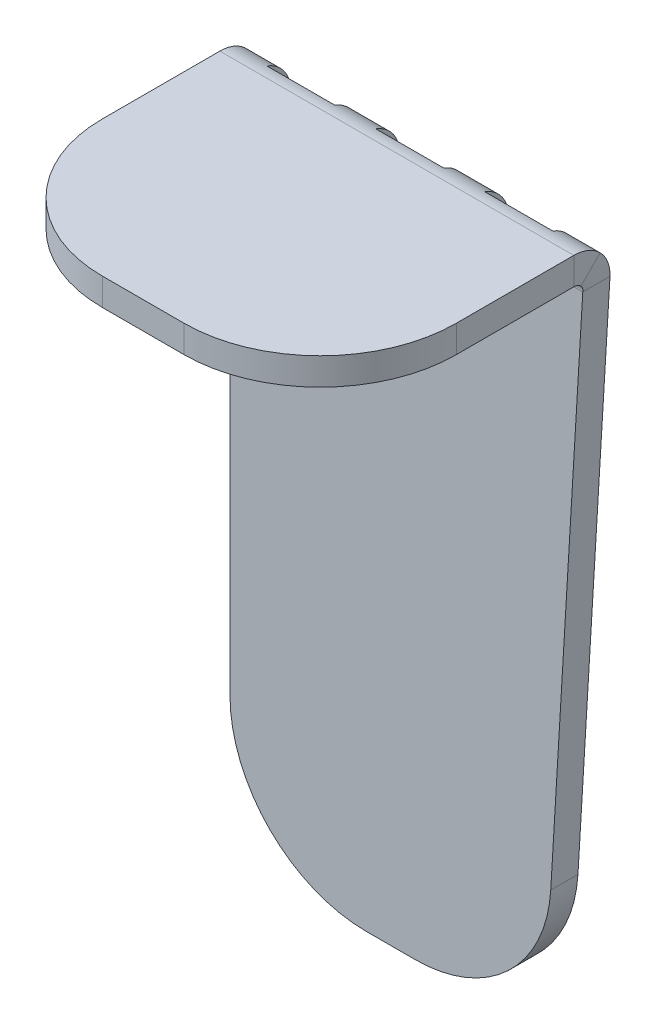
ISO-10303-21;
HEADER;
FILE_DESCRIPTION(('STEP AP214'),'2;1');
FILE_NAME('part.step','',(''),(''),'','','');
FILE_SCHEMA(('AUTOMOTIVE_DESIGN { 1 0 10303 214 1 1 1 1 }'));
ENDSEC;
DATA;
#1=APPLICATION_CONTEXT('core data for automotive mechanical design processes');
#2=APPLICATION_PROTOCOL_DEFINITION('international standard','automotive_design',2000,#1);
#3=PRODUCT_CONTEXT('',#1,'mechanical');
#4=PRODUCT('Part','Part','',(#3));
#5=PRODUCT_RELATED_PRODUCT_CATEGORY('part','',(#4));
#6=PRODUCT_DEFINITION_FORMATION('','',#4);
#7=PRODUCT_DEFINITION_CONTEXT('part definition',#1,'design');
#8=PRODUCT_DEFINITION('design','',#6,#7);
#9=PRODUCT_DEFINITION_SHAPE('','',#8);
#10=(LENGTH_UNIT() NAMED_UNIT(*) SI_UNIT(.MILLI.,.METRE.));
#11=(NAMED_UNIT(*) PLANE_ANGLE_UNIT() SI_UNIT($,.RADIAN.));
#12=(NAMED_UNIT(*) SI_UNIT($,.STERADIAN.) SOLID_ANGLE_UNIT());
#13=UNCERTAINTY_MEASURE_WITH_UNIT(LENGTH_MEASURE(1.E-05),#10,'distance_accuracy_value','');
#14=(GEOMETRIC_REPRESENTATION_CONTEXT(3) GLOBAL_UNCERTAINTY_ASSIGNED_CONTEXT((#13)) GLOBAL_UNIT_ASSIGNED_CONTEXT((#10,
#11,#12)) REPRESENTATION_CONTEXT('',''));
#15=CARTESIAN_POINT('',(0.,0.,0.));
#16=DIRECTION('',(0.,0.,1.));
#17=DIRECTION('',(1.,0.,0.));
#18=AXIS2_PLACEMENT_3D('',#15,#16,#17);
#19=CARTESIAN_POINT('',(0.,-20.6259060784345,19.3740939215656));
#20=DIRECTION('',(0.,1.,0.));
#21=DIRECTION('',(-1.,0.,0.));
#22=AXIS2_PLACEMENT_3D('',#19,#20,#21);
#23=PLANE('',#22);
#24=DIRECTION('',(0.,0.,1.));
#25=VECTOR('',#24,1.);
#26=CARTESIAN_POINT('',(26.,-20.6259060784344,-0.625906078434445));
#27=LINE('',#26,#25);
#28=CARTESIAN_POINT('',(26.,-20.6259060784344,0.743199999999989));
#29=VERTEX_POINT('',#28);
#30=CARTESIAN_POINT('',(26.,-20.6259060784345,9.37409392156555));
#31=VERTEX_POINT('',#30);
#32=EDGE_CURVE('E290',#29,#31,#27,.T.);
#33=ORIENTED_EDGE('',*,*,#32,.T.);
#34=CARTESIAN_POINT('',(16.,-20.6259060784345,9.37409392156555));
#35=DIRECTION('',(0.,1.,0.));
#36=DIRECTION('',(0.,0.,1.));
#37=AXIS2_PLACEMENT_3D('',#34,#35,#36);
#38=CIRCLE('',#37,10.);
#39=CARTESIAN_POINT('',(16.,-20.6259060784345,19.3740939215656));
#40=VERTEX_POINT('',#39);
#41=EDGE_CURVE('E324',#31,#40,#38,.F.);
#42=ORIENTED_EDGE('',*,*,#41,.T.);
#43=DIRECTION('',(-1.,0.,0.));
#44=VECTOR('',#43,1.);
#45=CARTESIAN_POINT('',(0.,-20.6259060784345,19.3740939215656));
#46=LINE('',#45,#44);
#47=CARTESIAN_POINT('',(10.,-20.6259060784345,19.3740939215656));
#48=VERTEX_POINT('',#47);
#49=EDGE_CURVE('E285',#40,#48,#46,.T.);
#50=ORIENTED_EDGE('',*,*,#49,.T.);
#51=CARTESIAN_POINT('',(10.,-20.6259060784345,9.37409392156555));
#52=DIRECTION('',(0.,1.,0.));
#53=DIRECTION('',(0.,0.,1.));
#54=AXIS2_PLACEMENT_3D('',#51,#52,#53);
#55=CIRCLE('',#54,10.);
#56=CARTESIAN_POINT('',(0.,-20.6259060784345,9.37409392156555));
#57=VERTEX_POINT('',#56);
#58=EDGE_CURVE('E321',#48,#57,#55,.F.);
#59=ORIENTED_EDGE('',*,*,#58,.T.);
#60=DIRECTION('',(0.,0.,-1.));
#61=VECTOR('',#60,1.);
#62=CARTESIAN_POINT('',(0.,-20.6259060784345,19.3740939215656));
#63=LINE('',#62,#61);
#64=CARTESIAN_POINT('',(0.,-20.6259060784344,0.743199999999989));
#65=VERTEX_POINT('',#64);
#66=EDGE_CURVE('E311',#57,#65,#63,.T.);
#67=ORIENTED_EDGE('',*,*,#66,.T.);
#68=DIRECTION('',(1.,0.,0.));
#69=VECTOR('',#68,1.);
#70=CARTESIAN_POINT('',(0.,-20.6259060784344,0.743199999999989));
#71=LINE('',#70,#69);
#72=EDGE_CURVE('E297',#65,#29,#71,.T.);
#73=ORIENTED_EDGE('',*,*,#72,.T.);
#74=EDGE_LOOP('',(#33,#42,#50,#59,#67,#73));
#75=FACE_BOUND('',#74,.T.);
#76=ADVANCED_FACE('F52',(#75),#23,.F.);
#77=CARTESIAN_POINT('',(0.,-18.6259060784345,19.3740939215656));
#78=DIRECTION('',(-1.,0.,0.));
#79=DIRECTION('',(0.,0.,-1.));
#80=AXIS2_PLACEMENT_3D('',#77,#78,#79);
#81=PLANE('',#80);
#82=ORIENTED_EDGE('',*,*,#66,.F.);
#83=DIRECTION('',(0.,-1.,0.));
#84=VECTOR('',#83,1.);
#85=CARTESIAN_POINT('',(0.,-18.6259060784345,9.37409392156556));
#86=LINE('',#85,#84);
#87=CARTESIAN_POINT('',(0.,-18.6259060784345,9.37409392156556));
#88=VERTEX_POINT('',#87);
#89=EDGE_CURVE('E12',#57,#88,#86,.F.);
#90=ORIENTED_EDGE('',*,*,#89,.T.);
#91=DIRECTION('',(0.,0.,-1.));
#92=VECTOR('',#91,1.);
#93=CARTESIAN_POINT('',(0.,-18.6259060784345,19.3740939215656));
#94=LINE('',#93,#92);
#95=CARTESIAN_POINT('',(0.,-18.6259060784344,0.74320000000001));
#96=VERTEX_POINT('',#95);
#97=EDGE_CURVE('E289',#88,#96,#94,.T.);
#98=ORIENTED_EDGE('',*,*,#97,.T.);
#99=DIRECTION('',(0.,1.,0.));
#100=VECTOR('',#99,1.);
#101=CARTESIAN_POINT('',(0.,-18.6259060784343,0.74320000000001));
#102=LINE('',#101,#100);
#103=EDGE_CURVE('E301',#65,#96,#102,.T.);
#104=ORIENTED_EDGE('',*,*,#103,.F.);
#105=EDGE_LOOP('',(#82,#90,#98,#104));
#106=FACE_BOUND('',#105,.T.);
#107=ADVANCED_FACE('F354',(#106),#81,.T.);
#108=CARTESIAN_POINT('',(0.,-18.6259060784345,19.3740939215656));
#109=DIRECTION('',(0.,0.,1.));
#110=DIRECTION('',(0.,-1.,0.));
#111=AXIS2_PLACEMENT_3D('',#108,#109,#110);
#112=PLANE('',#111);
#113=ORIENTED_EDGE('',*,*,#49,.F.);
#114=DIRECTION('',(0.,-1.,0.));
#115=VECTOR('',#114,1.);
#116=CARTESIAN_POINT('',(16.,-18.6259060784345,19.3740939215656));
#117=LINE('',#116,#115);
#118=CARTESIAN_POINT('',(16.,-18.6259060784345,19.3740939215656));
#119=VERTEX_POINT('',#118);
#120=EDGE_CURVE('E331',#40,#119,#117,.F.);
#121=ORIENTED_EDGE('',*,*,#120,.T.);
#122=DIRECTION('',(-1.,0.,0.));
#123=VECTOR('',#122,1.);
#124=CARTESIAN_POINT('',(0.,-18.6259060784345,19.3740939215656));
#125=LINE('',#124,#123);
#126=CARTESIAN_POINT('',(10.,-18.6259060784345,19.3740939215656));
#127=VERTEX_POINT('',#126);
#128=EDGE_CURVE('E280',#119,#127,#125,.T.);
#129=ORIENTED_EDGE('',*,*,#128,.T.);
#130=DIRECTION('',(0.,-1.,0.));
#131=VECTOR('',#130,1.);
#132=CARTESIAN_POINT('',(10.,-18.6259060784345,19.3740939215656));
#133=LINE('',#132,#131);
#134=EDGE_CURVE('E327',#127,#48,#133,.T.);
#135=ORIENTED_EDGE('',*,*,#134,.T.);
#136=EDGE_LOOP('',(#113,#121,#129,#135));
#137=FACE_BOUND('',#136,.T.);
#138=ADVANCED_FACE('F350',(#137),#112,.T.);
#139=CARTESIAN_POINT('',(26.,-18.6259060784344,-0.625906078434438));
#140=DIRECTION('',(1.,0.,0.));
#141=DIRECTION('',(0.,1.,0.));
#142=AXIS2_PLACEMENT_3D('',#139,#140,#141);
#143=PLANE('',#142);
#144=DIRECTION('',(0.,0.,1.));
#145=VECTOR('',#144,1.);
#146=CARTESIAN_POINT('',(26.,-18.6259060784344,-0.625906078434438));
#147=LINE('',#146,#145);
#148=CARTESIAN_POINT('',(26.,-18.6259060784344,0.743200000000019));
#149=VERTEX_POINT('',#148);
#150=CARTESIAN_POINT('',(26.,-18.6259060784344,9.37409392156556));
#151=VERTEX_POINT('',#150);
#152=EDGE_CURVE('E284',#149,#151,#147,.T.);
#153=ORIENTED_EDGE('',*,*,#152,.T.);
#154=DIRECTION('',(0.,-1.,0.));
#155=VECTOR('',#154,1.);
#156=CARTESIAN_POINT('',(26.,-18.6259060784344,9.37409392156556));
#157=LINE('',#156,#155);
#158=EDGE_CURVE('E305',#151,#31,#157,.T.);
#159=ORIENTED_EDGE('',*,*,#158,.T.);
#160=ORIENTED_EDGE('',*,*,#32,.F.);
#161=DIRECTION('',(0.,-1.,0.));
#162=VECTOR('',#161,1.);
#163=CARTESIAN_POINT('',(26.,-18.6259060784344,0.74320000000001));
#164=LINE('',#163,#162);
#165=EDGE_CURVE('E293',#149,#29,#164,.T.);
#166=ORIENTED_EDGE('',*,*,#165,.F.);
#167=EDGE_LOOP('',(#153,#159,#160,#166));
#168=FACE_BOUND('',#167,.T.);
#169=ADVANCED_FACE('F345',(#168),#143,.T.);
#170=CARTESIAN_POINT('',(0.,-18.6259060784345,19.3740939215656));
#171=DIRECTION('',(0.,1.,0.));
#172=DIRECTION('',(-1.,0.,0.));
#173=AXIS2_PLACEMENT_3D('',#170,#171,#172);
#174=PLANE('',#173);
#175=ORIENTED_EDGE('',*,*,#128,.F.);
#176=CARTESIAN_POINT('',(16.,-18.6259060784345,9.37409392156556));
#177=DIRECTION('',(0.,1.,0.));
#178=DIRECTION('',(0.,0.,1.));
#179=AXIS2_PLACEMENT_3D('',#176,#177,#178);
#180=CIRCLE('',#179,10.);
#181=EDGE_CURVE('E61',#119,#151,#180,.T.);
#182=ORIENTED_EDGE('',*,*,#181,.T.);
#183=ORIENTED_EDGE('',*,*,#152,.F.);
#184=DIRECTION('',(1.,0.,0.));
#185=VECTOR('',#184,1.);
#186=CARTESIAN_POINT('',(0.,-18.6259060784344,0.74320000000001));
#187=LINE('',#186,#185);
#188=EDGE_CURVE('E283',#96,#149,#187,.T.);
#189=ORIENTED_EDGE('',*,*,#188,.F.);
#190=ORIENTED_EDGE('',*,*,#97,.F.);
#191=CARTESIAN_POINT('',(10.,-18.6259060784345,9.37409392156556));
#192=DIRECTION('',(0.,1.,0.));
#193=DIRECTION('',(0.,0.,1.));
#194=AXIS2_PLACEMENT_3D('',#191,#192,#193);
#195=CIRCLE('',#194,10.);
#196=EDGE_CURVE('E73',#88,#127,#195,.T.);
#197=ORIENTED_EDGE('',*,*,#196,.T.);
#198=EDGE_LOOP('',(#175,#182,#183,#189,#190,#197));
#199=FACE_BOUND('',#198,.T.);
#200=ADVANCED_FACE('F339',(#199),#174,.T.);
#201=CARTESIAN_POINT('',(10.,-60.,-2.));
#202=DIRECTION('',(0.,0.,1.));
#203=DIRECTION('',(1.,0.,0.));
#204=AXIS2_PLACEMENT_3D('',#201,#202,#203);
#205=CYLINDRICAL_SURFACE('',#204,10.);
#206=CARTESIAN_POINT('',(10.,-60.,-2.));
#207=DIRECTION('',(0.,0.,-1.));
#208=DIRECTION('',(-1.,0.,0.));
#209=AXIS2_PLACEMENT_3D('',#206,#207,#208);
#210=CIRCLE('',#209,10.);
#211=CARTESIAN_POINT('',(10.,-70.,-2.));
#212=VERTEX_POINT('',#211);
#213=CARTESIAN_POINT('',(0.,-60.,-2.));
#214=VERTEX_POINT('',#213);
#215=EDGE_CURVE('E270',#212,#214,#210,.T.);
#216=ORIENTED_EDGE('',*,*,#215,.F.);
#217=DIRECTION('',(0.,0.,1.));
#218=VECTOR('',#217,1.);
#219=CARTESIAN_POINT('',(10.,-70.,-2.));
#220=LINE('',#219,#218);
#221=CARTESIAN_POINT('',(10.,-70.,0.));
#222=VERTEX_POINT('',#221);
#223=EDGE_CURVE('E580',#222,#212,#220,.F.);
#224=ORIENTED_EDGE('',*,*,#223,.F.);
#225=CARTESIAN_POINT('',(10.,-60.,0.));
#226=DIRECTION('',(0.,0.,-1.));
#227=DIRECTION('',(-1.,0.,0.));
#228=AXIS2_PLACEMENT_3D('',#225,#226,#227);
#229=CIRCLE('',#228,10.);
#230=CARTESIAN_POINT('',(0.,-60.,0.));
#231=VERTEX_POINT('',#230);
#232=EDGE_CURVE('E563',#231,#222,#229,.F.);
#233=ORIENTED_EDGE('',*,*,#232,.F.);
#234=DIRECTION('',(0.,0.,1.));
#235=VECTOR('',#234,1.);
#236=CARTESIAN_POINT('',(0.,-60.,-2.));
#237=LINE('',#236,#235);
#238=EDGE_CURVE('E314',#214,#231,#237,.T.);
#239=ORIENTED_EDGE('',*,*,#238,.F.);
#240=EDGE_LOOP('',(#216,#224,#233,#239));
#241=FACE_BOUND('',#240,.T.);
#242=ADVANCED_FACE('F618',(#241),#205,.T.);
#243=CARTESIAN_POINT('',(23.,-70.,-2.));
#244=DIRECTION('',(0.,-1.,0.));
#245=DIRECTION('',(0.,0.,-1.));
#246=AXIS2_PLACEMENT_3D('',#243,#244,#245);
#247=PLANE('',#246);
#248=DIRECTION('',(1.,0.,0.));
#249=VECTOR('',#248,1.);
#250=CARTESIAN_POINT('',(23.,-70.,0.));
#251=LINE('',#250,#249);
#252=CARTESIAN_POINT('',(13.5820161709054,-70.,0.));
#253=VERTEX_POINT('',#252);
#254=EDGE_CURVE('E559',#222,#253,#251,.T.);
#255=ORIENTED_EDGE('',*,*,#254,.F.);
#256=ORIENTED_EDGE('',*,*,#223,.T.);
#257=DIRECTION('',(1.,0.,0.));
#258=VECTOR('',#257,1.);
#259=CARTESIAN_POINT('',(23.,-70.,-2.));
#260=LINE('',#259,#258);
#261=CARTESIAN_POINT('',(13.5820161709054,-70.,-2.));
#262=VERTEX_POINT('',#261);
#263=EDGE_CURVE('E576',#212,#262,#260,.T.);
#264=ORIENTED_EDGE('',*,*,#263,.T.);
#265=DIRECTION('',(0.,0.,1.));
#266=VECTOR('',#265,1.);
#267=CARTESIAN_POINT('',(13.5820161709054,-70.,-2.));
#268=LINE('',#267,#266);
#269=EDGE_CURVE('E265',#262,#253,#268,.T.);
#270=ORIENTED_EDGE('',*,*,#269,.T.);
#271=EDGE_LOOP('',(#255,#256,#264,#270));
#272=FACE_BOUND('',#271,.T.);
#273=ADVANCED_FACE('F817',(#272),#247,.T.);
#274=CARTESIAN_POINT('',(13.5820161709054,-60.,-2.));
#275=DIRECTION('',(0.,0.,1.));
#276=DIRECTION('',(1.,0.,0.));
#277=AXIS2_PLACEMENT_3D('',#274,#275,#276);
#278=CYLINDRICAL_SURFACE('',#277,10.);
#279=CARTESIAN_POINT('',(13.5820161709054,-60.,-2.));
#280=DIRECTION('',(0.,0.,-1.));
#281=DIRECTION('',(-1.,0.,0.));
#282=AXIS2_PLACEMENT_3D('',#279,#280,#281);
#283=CIRCLE('',#282,10.);
#284=CARTESIAN_POINT('',(23.5640646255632,-60.5989229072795,-2.));
#285=VERTEX_POINT('',#284);
#286=EDGE_CURVE('E264',#285,#262,#283,.T.);
#287=ORIENTED_EDGE('',*,*,#286,.F.);
#288=DIRECTION('',(0.,0.,1.));
#289=VECTOR('',#288,1.);
#290=CARTESIAN_POINT('',(23.5640646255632,-60.5989229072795,-2.));
#291=LINE('',#290,#289);
#292=CARTESIAN_POINT('',(23.5640646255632,-60.5989229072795,0.));
#293=VERTEX_POINT('',#292);
#294=EDGE_CURVE('E235',#293,#285,#291,.F.);
#295=ORIENTED_EDGE('',*,*,#294,.F.);
#296=CARTESIAN_POINT('',(13.5820161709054,-60.,0.));
#297=DIRECTION('',(0.,0.,-1.));
#298=DIRECTION('',(-1.,0.,0.));
#299=AXIS2_PLACEMENT_3D('',#296,#297,#298);
#300=CIRCLE('',#299,10.);
#301=EDGE_CURVE('E556',#253,#293,#300,.F.);
#302=ORIENTED_EDGE('',*,*,#301,.F.);
#303=ORIENTED_EDGE('',*,*,#269,.F.);
#304=EDGE_LOOP('',(#287,#295,#302,#303));
#305=FACE_BOUND('',#304,.T.);
#306=ADVANCED_FACE('F809',(#305),#278,.T.);
#307=CARTESIAN_POINT('',(0.,0.,-2.));
#308=DIRECTION('',(0.,0.,-1.));
#309=DIRECTION('',(-1.,0.,0.));
#310=AXIS2_PLACEMENT_3D('',#307,#308,#309);
#311=PLANE('',#310);
#312=DIRECTION('',(0.,-1.,0.));
#313=VECTOR('',#312,1.);
#314=CARTESIAN_POINT('',(0.,0.,-2.));
#315=LINE('',#314,#313);
#316=CARTESIAN_POINT('',(0.,-21.3691060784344,-2.));
#317=VERTEX_POINT('',#316);
#318=EDGE_CURVE('E261',#317,#214,#315,.T.);
#319=ORIENTED_EDGE('',*,*,#318,.F.);
#320=DIRECTION('',(1.,0.,0.));
#321=VECTOR('',#320,1.);
#322=CARTESIAN_POINT('',(0.,-21.3691060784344,-2.));
#323=LINE('',#322,#321);
#324=CARTESIAN_POINT('',(25.9178536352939,-21.3691060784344,-2.));
#325=VERTEX_POINT('',#324);
#326=EDGE_CURVE('E246',#317,#325,#323,.T.);
#327=ORIENTED_EDGE('',*,*,#326,.T.);
#328=DIRECTION('',(0.0598922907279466,0.998204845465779,0.));
#329=VECTOR('',#328,1.);
#330=CARTESIAN_POINT('',(26.,-20.,-2.));
#331=LINE('',#330,#329);
#332=EDGE_CURVE('E236',#285,#325,#331,.T.);
#333=ORIENTED_EDGE('',*,*,#332,.F.);
#334=ORIENTED_EDGE('',*,*,#286,.T.);
#335=ORIENTED_EDGE('',*,*,#263,.F.);
#336=ORIENTED_EDGE('',*,*,#215,.T.);
#337=EDGE_LOOP('',(#319,#327,#333,#334,#335,#336));
#338=FACE_BOUND('',#337,.T.);
#339=ADVANCED_FACE('F258',(#338),#311,.T.);
#340=CARTESIAN_POINT('',(26.,-20.,-2.));
#341=DIRECTION('',(0.998204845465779,-0.0598922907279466,0.));
#342=DIRECTION('',(0.0598922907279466,0.998204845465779,0.));
#343=AXIS2_PLACEMENT_3D('',#340,#341,#342);
#344=PLANE('',#343);
#345=ORIENTED_EDGE('',*,*,#332,.T.);
#346=CARTESIAN_POINT('',(25.9178536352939,-21.3691060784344,0.));
#347=CARTESIAN_POINT('',(25.9178536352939,-21.3691060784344,-2.));
#348=B_SPLINE_CURVE_WITH_KNOTS('',1,(#346,#347),.UNSPECIFIED.,.F.,.F.,(2,2),(0.,1.),.UNSPECIFIED.);
#349=CARTESIAN_POINT('',(25.9178536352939,-21.3691060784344,0.));
#350=VERTEX_POINT('',#349);
#351=EDGE_CURVE('E220',#325,#350,#348,.F.);
#352=ORIENTED_EDGE('',*,*,#351,.T.);
#353=DIRECTION('',(0.0598922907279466,0.998204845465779,0.));
#354=VECTOR('',#353,1.);
#355=CARTESIAN_POINT('',(26.,-20.,0.));
#356=LINE('',#355,#354);
#357=EDGE_CURVE('E555',#293,#350,#356,.T.);
#358=ORIENTED_EDGE('',*,*,#357,.F.);
#359=ORIENTED_EDGE('',*,*,#294,.T.);
#360=EDGE_LOOP('',(#345,#352,#358,#359));
#361=FACE_BOUND('',#360,.T.);
#362=ADVANCED_FACE('F267',(#361),#344,.T.);
#363=CARTESIAN_POINT('',(0.,0.,0.));
#364=DIRECTION('',(0.,0.,-1.));
#365=DIRECTION('',(-1.,0.,0.));
#366=AXIS2_PLACEMENT_3D('',#363,#364,#365);
#367=PLANE('',#366);
#368=DIRECTION('',(1.,0.,0.));
#369=VECTOR('',#368,1.);
#370=CARTESIAN_POINT('',(0.,-21.3691060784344,0.));
#371=LINE('',#370,#369);
#372=CARTESIAN_POINT('',(0.,-21.3691060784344,0.));
#373=VERTEX_POINT('',#372);
#374=EDGE_CURVE('E545',#373,#350,#371,.T.);
#375=ORIENTED_EDGE('',*,*,#374,.F.);
#376=DIRECTION('',(0.,-1.,0.));
#377=VECTOR('',#376,1.);
#378=CARTESIAN_POINT('',(0.,0.,0.));
#379=LINE('',#378,#377);
#380=EDGE_CURVE('E566',#373,#231,#379,.T.);
#381=ORIENTED_EDGE('',*,*,#380,.T.);
#382=ORIENTED_EDGE('',*,*,#232,.T.);
#383=ORIENTED_EDGE('',*,*,#254,.T.);
#384=ORIENTED_EDGE('',*,*,#301,.T.);
#385=ORIENTED_EDGE('',*,*,#357,.T.);
#386=EDGE_LOOP('',(#375,#381,#382,#383,#384,#385));
#387=FACE_BOUND('',#386,.T.);
#388=ADVANCED_FACE('F604',(#387),#367,.F.);
#389=CARTESIAN_POINT('',(0.,0.,-2.));
#390=DIRECTION('',(-1.,0.,0.));
#391=DIRECTION('',(0.,-1.,0.));
#392=AXIS2_PLACEMENT_3D('',#389,#390,#391);
#393=PLANE('',#392);
#394=ORIENTED_EDGE('',*,*,#380,.F.);
#395=DIRECTION('',(0.,0.,-1.));
#396=VECTOR('',#395,1.);
#397=CARTESIAN_POINT('',(0.,-21.3691060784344,-2.00000000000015));
#398=LINE('',#397,#396);
#399=EDGE_CURVE('E368',#373,#317,#398,.T.);
#400=ORIENTED_EDGE('',*,*,#399,.T.);
#401=ORIENTED_EDGE('',*,*,#318,.T.);
#402=ORIENTED_EDGE('',*,*,#238,.T.);
#403=EDGE_LOOP('',(#394,#400,#401,#402));
#404=FACE_BOUND('',#403,.T.);
#405=ADVANCED_FACE('F608',(#404),#393,.T.);
#406=CARTESIAN_POINT('',(23.5,-21.3691060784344,0.7432));
#407=DIRECTION('',(-1.,0.,0.));
#408=DIRECTION('',(0.,0.,1.));
#409=AXIS2_PLACEMENT_3D('',#406,#407,#408);
#410=PLANE('',#409);
#411=DIRECTION('',(0.,0.347735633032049,-0.937592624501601));
#412=VECTOR('',#411,1.);
#413=CARTESIAN_POINT('',(23.5,-20.4151976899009,-1.82880408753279));
#414=LINE('',#413,#412);
#415=CARTESIAN_POINT('',(23.5,-21.110668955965,0.0463811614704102));
#416=VERTEX_POINT('',#415);
#417=CARTESIAN_POINT('',(23.5,-20.4151976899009,-1.82880408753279));
#418=VERTEX_POINT('',#417);
#419=EDGE_CURVE('E542',#416,#418,#414,.T.);
#420=ORIENTED_EDGE('',*,*,#419,.F.);
#421=CARTESIAN_POINT('',(23.5,-21.3691060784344,0.7432));
#422=DIRECTION('',(1.,0.,0.));
#423=DIRECTION('',(0.,0.,-1.));
#424=AXIS2_PLACEMENT_3D('',#421,#422,#423);
#425=CIRCLE('',#424,0.7432);
#426=CARTESIAN_POINT('',(23.5,-20.6722872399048,0.484762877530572));
#427=VERTEX_POINT('',#426);
#428=EDGE_CURVE('E410',#416,#427,#425,.T.);
#429=ORIENTED_EDGE('',*,*,#428,.T.);
#430=DIRECTION('',(0.,0.937592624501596,-0.347735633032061));
#431=VECTOR('',#430,1.);
#432=CARTESIAN_POINT('',(23.5,-18.7971019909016,-0.210708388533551));
#433=LINE('',#432,#431);
#434=CARTESIAN_POINT('',(23.5,-18.7971019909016,-0.210708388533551));
#435=VERTEX_POINT('',#434);
#436=EDGE_CURVE('E539',#427,#435,#433,.T.);
#437=ORIENTED_EDGE('',*,*,#436,.T.);
#438=CARTESIAN_POINT('',(23.5,-21.3691060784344,0.7432));
#439=DIRECTION('',(1.,0.,0.));
#440=DIRECTION('',(0.,0.,1.));
#441=AXIS2_PLACEMENT_3D('',#438,#439,#440);
#442=CIRCLE('',#441,2.7432);
#443=EDGE_CURVE('E1053',#418,#435,#442,.T.);
#444=ORIENTED_EDGE('',*,*,#443,.F.);
#445=EDGE_LOOP('',(#420,#429,#437,#444));
#446=FACE_BOUND('',#445,.T.);
#447=ADVANCED_FACE('F612',(#446),#410,.T.);
#448=CARTESIAN_POINT('',(21.,-18.7971019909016,-0.210708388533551));
#449=DIRECTION('',(0.,-0.347735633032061,-0.937592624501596));
#450=DIRECTION('',(-1.,0.,0.));
#451=AXIS2_PLACEMENT_3D('',#448,#449,#450);
#452=PLANE('',#451);
#453=ORIENTED_EDGE('',*,*,#436,.F.);
#454=DIRECTION('',(1.,0.,0.));
#455=VECTOR('',#454,1.);
#456=CARTESIAN_POINT('',(-13.2612525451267,-20.6722872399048,0.484762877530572));
#457=LINE('',#456,#455);
#458=CARTESIAN_POINT('',(18.5,-20.6722872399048,0.484762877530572));
#459=VERTEX_POINT('',#458);
#460=EDGE_CURVE('E416',#427,#459,#457,.F.);
#461=ORIENTED_EDGE('',*,*,#460,.T.);
#462=DIRECTION('',(0.,0.937592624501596,-0.347735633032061));
#463=VECTOR('',#462,1.);
#464=CARTESIAN_POINT('',(18.5,-18.7971019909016,-0.210708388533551));
#465=LINE('',#464,#463);
#466=CARTESIAN_POINT('',(18.5,-18.7971019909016,-0.210708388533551));
#467=VERTEX_POINT('',#466);
#468=EDGE_CURVE('E536',#459,#467,#465,.T.);
#469=ORIENTED_EDGE('',*,*,#468,.T.);
#470=DIRECTION('',(-1.,0.,0.));
#471=VECTOR('',#470,1.);
#472=CARTESIAN_POINT('',(18.5,-18.7971019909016,-0.210708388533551));
#473=LINE('',#472,#471);
#474=EDGE_CURVE('E1058',#435,#467,#473,.T.);
#475=ORIENTED_EDGE('',*,*,#474,.F.);
#476=EDGE_LOOP('',(#453,#461,#469,#475));
#477=FACE_BOUND('',#476,.T.);
#478=ADVANCED_FACE('F763',(#477),#452,.T.);
#479=CARTESIAN_POINT('',(18.5,-21.3691060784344,0.7432));
#480=DIRECTION('',(1.,0.,0.));
#481=DIRECTION('',(0.,0.,-1.));
#482=AXIS2_PLACEMENT_3D('',#479,#480,#481);
#483=PLANE('',#482);
#484=ORIENTED_EDGE('',*,*,#468,.F.);
#485=CARTESIAN_POINT('',(18.5,-21.3691060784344,0.7432));
#486=DIRECTION('',(1.,0.,0.));
#487=DIRECTION('',(0.,0.,-1.));
#488=AXIS2_PLACEMENT_3D('',#485,#486,#487);
#489=CIRCLE('',#488,0.7432);
#490=CARTESIAN_POINT('',(18.5,-21.110668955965,0.0463811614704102));
#491=VERTEX_POINT('',#490);
#492=EDGE_CURVE('E411',#459,#491,#489,.F.);
#493=ORIENTED_EDGE('',*,*,#492,.T.);
#494=DIRECTION('',(0.,0.34773563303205,-0.937592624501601));
#495=VECTOR('',#494,1.);
#496=CARTESIAN_POINT('',(18.5,-20.4151976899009,-1.82880408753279));
#497=LINE('',#496,#495);
#498=CARTESIAN_POINT('',(18.5,-20.4151976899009,-1.82880408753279));
#499=VERTEX_POINT('',#498);
#500=EDGE_CURVE('E533',#491,#499,#497,.T.);
#501=ORIENTED_EDGE('',*,*,#500,.T.);
#502=CARTESIAN_POINT('',(18.5,-21.3691060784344,0.7432));
#503=DIRECTION('',(-1.,0.,0.));
#504=DIRECTION('',(0.,0.,-1.));
#505=AXIS2_PLACEMENT_3D('',#502,#503,#504);
#506=CIRCLE('',#505,2.7432);
#507=EDGE_CURVE('E1063',#467,#499,#506,.T.);
#508=ORIENTED_EDGE('',*,*,#507,.F.);
#509=EDGE_LOOP('',(#484,#493,#501,#508));
#510=FACE_BOUND('',#509,.T.);
#511=ADVANCED_FACE('F753',(#510),#483,.T.);
#512=CARTESIAN_POINT('',(15.5,-21.3691060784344,0.7432));
#513=DIRECTION('',(-1.,0.,0.));
#514=DIRECTION('',(0.,0.,1.));
#515=AXIS2_PLACEMENT_3D('',#512,#513,#514);
#516=PLANE('',#515);
#517=DIRECTION('',(0.,0.347735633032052,-0.9375926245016));
#518=VECTOR('',#517,1.);
#519=CARTESIAN_POINT('',(15.5,-20.4151976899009,-1.82880408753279));
#520=LINE('',#519,#518);
#521=CARTESIAN_POINT('',(15.5,-21.110668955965,0.0463811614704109));
#522=VERTEX_POINT('',#521);
#523=CARTESIAN_POINT('',(15.5,-20.4151976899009,-1.82880408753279));
#524=VERTEX_POINT('',#523);
#525=EDGE_CURVE('E530',#522,#524,#520,.T.);
#526=ORIENTED_EDGE('',*,*,#525,.F.);
#527=CARTESIAN_POINT('',(15.5,-21.3691060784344,0.7432));
#528=DIRECTION('',(1.,0.,0.));
#529=DIRECTION('',(0.,0.,-1.));
#530=AXIS2_PLACEMENT_3D('',#527,#528,#529);
#531=CIRCLE('',#530,0.7432);
#532=CARTESIAN_POINT('',(15.5,-20.6722872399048,0.484762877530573));
#533=VERTEX_POINT('',#532);
#534=EDGE_CURVE('E394',#522,#533,#531,.T.);
#535=ORIENTED_EDGE('',*,*,#534,.T.);
#536=DIRECTION('',(0.,0.937592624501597,-0.347735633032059));
#537=VECTOR('',#536,1.);
#538=CARTESIAN_POINT('',(15.5,-18.7971019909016,-0.210708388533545));
#539=LINE('',#538,#537);
#540=CARTESIAN_POINT('',(15.5,-18.7971019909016,-0.210708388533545));
#541=VERTEX_POINT('',#540);
#542=EDGE_CURVE('E527',#533,#541,#539,.T.);
#543=ORIENTED_EDGE('',*,*,#542,.T.);
#544=CARTESIAN_POINT('',(15.5,-21.3691060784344,0.7432));
#545=DIRECTION('',(1.,0.,0.));
#546=DIRECTION('',(0.,0.,1.));
#547=AXIS2_PLACEMENT_3D('',#544,#545,#546);
#548=CIRCLE('',#547,2.7432);
#549=EDGE_CURVE('E1033',#524,#541,#548,.T.);
#550=ORIENTED_EDGE('',*,*,#549,.F.);
#551=EDGE_LOOP('',(#526,#535,#543,#550));
#552=FACE_BOUND('',#551,.T.);
#553=ADVANCED_FACE('F743',(#552),#516,.T.);
#554=CARTESIAN_POINT('',(13.,-18.7971019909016,-0.210708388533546));
#555=DIRECTION('',(0.,-0.347735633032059,-0.937592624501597));
#556=DIRECTION('',(-1.,0.,0.));
#557=AXIS2_PLACEMENT_3D('',#554,#555,#556);
#558=PLANE('',#557);
#559=ORIENTED_EDGE('',*,*,#542,.F.);
#560=DIRECTION('',(1.,0.,0.));
#561=VECTOR('',#560,1.);
#562=CARTESIAN_POINT('',(-13.2612525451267,-20.6722872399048,0.484762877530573));
#563=LINE('',#562,#561);
#564=CARTESIAN_POINT('',(10.5,-20.6722872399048,0.484762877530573));
#565=VERTEX_POINT('',#564);
#566=EDGE_CURVE('E400',#533,#565,#563,.F.);
#567=ORIENTED_EDGE('',*,*,#566,.T.);
#568=DIRECTION('',(0.,0.937592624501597,-0.347735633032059));
#569=VECTOR('',#568,1.);
#570=CARTESIAN_POINT('',(10.5,-18.7971019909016,-0.210708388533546));
#571=LINE('',#570,#569);
#572=CARTESIAN_POINT('',(10.5,-18.7971019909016,-0.210708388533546));
#573=VERTEX_POINT('',#572);
#574=EDGE_CURVE('E524',#565,#573,#571,.T.);
#575=ORIENTED_EDGE('',*,*,#574,.T.);
#576=DIRECTION('',(-1.,0.,0.));
#577=VECTOR('',#576,1.);
#578=CARTESIAN_POINT('',(10.5,-18.7971019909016,-0.210708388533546));
#579=LINE('',#578,#577);
#580=EDGE_CURVE('E1038',#541,#573,#579,.T.);
#581=ORIENTED_EDGE('',*,*,#580,.F.);
#582=EDGE_LOOP('',(#559,#567,#575,#581));
#583=FACE_BOUND('',#582,.T.);
#584=ADVANCED_FACE('F733',(#583),#558,.T.);
#585=CARTESIAN_POINT('',(10.5,-21.3691060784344,0.7432));
#586=DIRECTION('',(1.,0.,0.));
#587=DIRECTION('',(0.,0.,-1.));
#588=AXIS2_PLACEMENT_3D('',#585,#586,#587);
#589=PLANE('',#588);
#590=ORIENTED_EDGE('',*,*,#574,.F.);
#591=CARTESIAN_POINT('',(10.5,-21.3691060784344,0.7432));
#592=DIRECTION('',(1.,0.,0.));
#593=DIRECTION('',(0.,0.,-1.));
#594=AXIS2_PLACEMENT_3D('',#591,#592,#593);
#595=CIRCLE('',#594,0.7432);
#596=CARTESIAN_POINT('',(10.5,-21.110668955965,0.0463811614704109));
#597=VERTEX_POINT('',#596);
#598=EDGE_CURVE('E395',#565,#597,#595,.F.);
#599=ORIENTED_EDGE('',*,*,#598,.T.);
#600=DIRECTION('',(0.,0.347735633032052,-0.9375926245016));
#601=VECTOR('',#600,1.);
#602=CARTESIAN_POINT('',(10.5,-20.4151976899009,-1.82880408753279));
#603=LINE('',#602,#601);
#604=CARTESIAN_POINT('',(10.5,-20.4151976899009,-1.82880408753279));
#605=VERTEX_POINT('',#604);
#606=EDGE_CURVE('E521',#597,#605,#603,.T.);
#607=ORIENTED_EDGE('',*,*,#606,.T.);
#608=CARTESIAN_POINT('',(10.5,-21.3691060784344,0.7432));
#609=DIRECTION('',(-1.,0.,0.));
#610=DIRECTION('',(0.,0.,-1.));
#611=AXIS2_PLACEMENT_3D('',#608,#609,#610);
#612=CIRCLE('',#611,2.7432);
#613=EDGE_CURVE('E1043',#573,#605,#612,.T.);
#614=ORIENTED_EDGE('',*,*,#613,.F.);
#615=EDGE_LOOP('',(#590,#599,#607,#614));
#616=FACE_BOUND('',#615,.T.);
#617=ADVANCED_FACE('F723',(#616),#589,.T.);
#618=CARTESIAN_POINT('',(7.50000000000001,-21.3691060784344,0.7432));
#619=DIRECTION('',(-1.,0.,0.));
#620=DIRECTION('',(0.,0.,1.));
#621=AXIS2_PLACEMENT_3D('',#618,#619,#620);
#622=PLANE('',#621);
#623=DIRECTION('',(0.,0.347735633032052,-0.9375926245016));
#624=VECTOR('',#623,1.);
#625=CARTESIAN_POINT('',(7.50000000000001,-20.4151976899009,-1.82880408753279));
#626=LINE('',#625,#624);
#627=CARTESIAN_POINT('',(7.50000000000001,-21.110668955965,0.0463811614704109));
#628=VERTEX_POINT('',#627);
#629=CARTESIAN_POINT('',(7.50000000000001,-20.4151976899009,-1.82880408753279));
#630=VERTEX_POINT('',#629);
#631=EDGE_CURVE('E518',#628,#630,#626,.T.);
#632=ORIENTED_EDGE('',*,*,#631,.F.);
#633=CARTESIAN_POINT('',(7.50000000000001,-21.3691060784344,0.7432));
#634=DIRECTION('',(1.,0.,0.));
#635=DIRECTION('',(0.,0.,-1.));
#636=AXIS2_PLACEMENT_3D('',#633,#634,#635);
#637=CIRCLE('',#636,0.7432);
#638=CARTESIAN_POINT('',(7.50000000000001,-20.6722872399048,0.484762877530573));
#639=VERTEX_POINT('',#638);
#640=EDGE_CURVE('E387',#628,#639,#637,.T.);
#641=ORIENTED_EDGE('',*,*,#640,.T.);
#642=DIRECTION('',(0.,0.937592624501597,-0.347735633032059));
#643=VECTOR('',#642,1.);
#644=CARTESIAN_POINT('',(7.50000000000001,-18.7971019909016,-0.210708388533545));
#645=LINE('',#644,#643);
#646=CARTESIAN_POINT('',(7.50000000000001,-18.7971019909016,-0.210708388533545));
#647=VERTEX_POINT('',#646);
#648=EDGE_CURVE('E514',#639,#647,#645,.T.);
#649=ORIENTED_EDGE('',*,*,#648,.T.);
#650=CARTESIAN_POINT('',(7.50000000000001,-21.3691060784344,0.7432));
#651=DIRECTION('',(1.,0.,0.));
#652=DIRECTION('',(0.,0.,1.));
#653=AXIS2_PLACEMENT_3D('',#650,#651,#652);
#654=CIRCLE('',#653,2.7432);
#655=EDGE_CURVE('E252',#630,#647,#654,.T.);
#656=ORIENTED_EDGE('',*,*,#655,.F.);
#657=EDGE_LOOP('',(#632,#641,#649,#656));
#658=FACE_BOUND('',#657,.T.);
#659=ADVANCED_FACE('F714',(#658),#622,.T.);
#660=CARTESIAN_POINT('',(5.00000000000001,-18.7971019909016,-0.210708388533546));
#661=DIRECTION('',(0.,-0.347735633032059,-0.937592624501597));
#662=DIRECTION('',(-1.,0.,0.));
#663=AXIS2_PLACEMENT_3D('',#660,#661,#662);
#664=PLANE('',#663);
#665=ORIENTED_EDGE('',*,*,#648,.F.);
#666=DIRECTION('',(1.,0.,0.));
#667=VECTOR('',#666,1.);
#668=CARTESIAN_POINT('',(-13.2612525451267,-20.6722872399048,0.484762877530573));
#669=LINE('',#668,#667);
#670=CARTESIAN_POINT('',(2.50000000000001,-20.6722872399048,0.484762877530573));
#671=VERTEX_POINT('',#670);
#672=EDGE_CURVE('E383',#639,#671,#669,.F.);
#673=ORIENTED_EDGE('',*,*,#672,.T.);
#674=DIRECTION('',(0.,0.937592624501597,-0.347735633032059));
#675=VECTOR('',#674,1.);
#676=CARTESIAN_POINT('',(2.50000000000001,-18.7971019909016,-0.210708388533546));
#677=LINE('',#676,#675);
#678=CARTESIAN_POINT('',(2.50000000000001,-18.7971019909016,-0.210708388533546));
#679=VERTEX_POINT('',#678);
#680=EDGE_CURVE('E506',#671,#679,#677,.T.);
#681=ORIENTED_EDGE('',*,*,#680,.T.);
#682=DIRECTION('',(-1.,0.,0.));
#683=VECTOR('',#682,1.);
#684=CARTESIAN_POINT('',(2.50000000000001,-18.7971019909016,-0.210708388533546));
#685=LINE('',#684,#683);
#686=EDGE_CURVE('E1018',#647,#679,#685,.T.);
#687=ORIENTED_EDGE('',*,*,#686,.F.);
#688=EDGE_LOOP('',(#665,#673,#681,#687));
#689=FACE_BOUND('',#688,.T.);
#690=ADVANCED_FACE('F705',(#689),#664,.T.);
#691=CARTESIAN_POINT('',(2.50000000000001,-21.3691060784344,0.7432));
#692=DIRECTION('',(1.,0.,0.));
#693=DIRECTION('',(0.,0.,-1.));
#694=AXIS2_PLACEMENT_3D('',#691,#692,#693);
#695=PLANE('',#694);
#696=ORIENTED_EDGE('',*,*,#680,.F.);
#697=CARTESIAN_POINT('',(2.50000000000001,-21.3691060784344,0.7432));
#698=DIRECTION('',(1.,0.,0.));
#699=DIRECTION('',(0.,0.,-1.));
#700=AXIS2_PLACEMENT_3D('',#697,#698,#699);
#701=CIRCLE('',#700,0.7432);
#702=CARTESIAN_POINT('',(2.50000000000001,-21.110668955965,0.0463811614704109));
#703=VERTEX_POINT('',#702);
#704=EDGE_CURVE('E378',#671,#703,#701,.F.);
#705=ORIENTED_EDGE('',*,*,#704,.T.);
#706=DIRECTION('',(0.,0.347735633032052,-0.9375926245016));
#707=VECTOR('',#706,1.);
#708=CARTESIAN_POINT('',(2.50000000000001,-20.4151976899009,-1.82880408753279));
#709=LINE('',#708,#707);
#710=CARTESIAN_POINT('',(2.50000000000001,-20.4151976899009,-1.82880408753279));
#711=VERTEX_POINT('',#710);
#712=EDGE_CURVE('E515',#703,#711,#709,.T.);
#713=ORIENTED_EDGE('',*,*,#712,.T.);
#714=CARTESIAN_POINT('',(2.50000000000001,-21.3691060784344,0.7432));
#715=DIRECTION('',(-1.,0.,0.));
#716=DIRECTION('',(0.,0.,-1.));
#717=AXIS2_PLACEMENT_3D('',#714,#715,#716);
#718=CIRCLE('',#717,2.7432);
#719=EDGE_CURVE('E1023',#679,#711,#718,.T.);
#720=ORIENTED_EDGE('',*,*,#719,.F.);
#721=EDGE_LOOP('',(#696,#705,#713,#720));
#722=FACE_BOUND('',#721,.T.);
#723=ADVANCED_FACE('F471',(#722),#695,.T.);
#724=CARTESIAN_POINT('',(0.,-21.3691060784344,0.7432));
#725=DIRECTION('',(-1.,0.,0.));
#726=DIRECTION('',(0.,0.,1.));
#727=AXIS2_PLACEMENT_3D('',#724,#725,#726);
#728=PLANE('',#727);
#729=ORIENTED_EDGE('',*,*,#399,.F.);
#730=CARTESIAN_POINT('',(0.,-21.3691060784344,0.7432));
#731=DIRECTION('',(1.,0.,0.));
#732=DIRECTION('',(0.,0.,-1.));
#733=AXIS2_PLACEMENT_3D('',#730,#731,#732);
#734=CIRCLE('',#733,0.7432);
#735=EDGE_CURVE('E363',#373,#65,#734,.T.);
#736=ORIENTED_EDGE('',*,*,#735,.T.);
#737=ORIENTED_EDGE('',*,*,#103,.T.);
#738=CARTESIAN_POINT('',(0.,-21.3691060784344,0.7432));
#739=DIRECTION('',(1.,0.,0.));
#740=DIRECTION('',(0.,0.,1.));
#741=AXIS2_PLACEMENT_3D('',#738,#739,#740);
#742=CIRCLE('',#741,2.7432);
#743=EDGE_CURVE('E425',#317,#96,#742,.T.);
#744=ORIENTED_EDGE('',*,*,#743,.F.);
#745=EDGE_LOOP('',(#729,#736,#737,#744));
#746=FACE_BOUND('',#745,.T.);
#747=ADVANCED_FACE('F367',(#746),#728,.T.);
#748=CARTESIAN_POINT('',(26.,-21.3691060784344,0.7432));
#749=DIRECTION('',(1.,0.,0.));
#750=DIRECTION('',(0.,0.,-1.));
#751=AXIS2_PLACEMENT_3D('',#748,#749,#750);
#752=PLANE('',#751);
#753=ORIENTED_EDGE('',*,*,#165,.T.);
#754=CARTESIAN_POINT('',(26.,-21.3691060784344,0.7432));
#755=DIRECTION('',(1.,0.,0.));
#756=DIRECTION('',(0.,0.,-1.));
#757=AXIS2_PLACEMENT_3D('',#754,#755,#756);
#758=CIRCLE('',#757,0.7432);
#759=CARTESIAN_POINT('',(26.,-20.8435843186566,0.217678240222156));
#760=VERTEX_POINT('',#759);
#761=EDGE_CURVE('E366',#29,#760,#758,.F.);
#762=ORIENTED_EDGE('',*,*,#761,.T.);
#763=CARTESIAN_POINT('',(26.,-19.4293707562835,-1.19653532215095));
#764=CARTESIAN_POINT('',(26.,-20.8435843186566,0.217678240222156));
#765=B_SPLINE_CURVE_WITH_KNOTS('',1,(#763,#764),.UNSPECIFIED.,.F.,.F.,(2,2),(0.,1.),.UNSPECIFIED.);
#766=CARTESIAN_POINT('',(26.,-19.4293707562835,-1.19653532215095));
#767=VERTEX_POINT('',#766);
#768=EDGE_CURVE('E494',#760,#767,#765,.F.);
#769=ORIENTED_EDGE('',*,*,#768,.T.);
#770=CARTESIAN_POINT('',(26.,-21.3691060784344,0.7432));
#771=DIRECTION('',(-1.,0.,0.));
#772=DIRECTION('',(0.,0.,-1.));
#773=AXIS2_PLACEMENT_3D('',#770,#771,#772);
#774=CIRCLE('',#773,2.7432);
#775=EDGE_CURVE('E250',#149,#767,#774,.T.);
#776=ORIENTED_EDGE('',*,*,#775,.F.);
#777=EDGE_LOOP('',(#753,#762,#769,#776));
#778=FACE_BOUND('',#777,.T.);
#779=ADVANCED_FACE('F441',(#778),#752,.T.);
#780=CARTESIAN_POINT('',(26.,-19.4293707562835,-1.19653532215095));
#781=CARTESIAN_POINT('',(25.9863064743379,-19.6833272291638,-1.45049179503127));
#782=CARTESIAN_POINT('',(25.9726178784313,-19.987578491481,-1.6537708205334));
#783=CARTESIAN_POINT('',(25.9452357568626,-20.65107928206,-1.92860184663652));
#784=CARTESIAN_POINT('',(25.931547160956,-21.0099573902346,-2.));
#785=CARTESIAN_POINT('',(25.9178536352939,-21.3691060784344,-2.));
#786=CARTESIAN_POINT('',(26.,-20.8435843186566,0.217678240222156));
#787=CARTESIAN_POINT('',(25.9863065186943,-20.9123871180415,0.148875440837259));
#788=CARTESIAN_POINT('',(25.9726178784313,-20.9948164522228,0.0938019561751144));
#789=CARTESIAN_POINT('',(25.9452357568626,-21.1745750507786,0.0193435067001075));
#790=CARTESIAN_POINT('',(25.9315471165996,-21.2718042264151,0.));
#791=CARTESIAN_POINT('',(25.9178536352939,-21.3691060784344,0.));
#792=B_SPLINE_SURFACE_WITH_KNOTS('',1,3,((#780,#781,#782,#783,#784,#785),(#786,#787,#788,#789,
#790,#791)),.UNSPECIFIED.,.F.,.F.,.F.,(2,2),(4,2,4),(0.,1.),(0.,0.5,1.),.UNSPECIFIED.);
#793=CARTESIAN_POINT('',(26.,-20.8435843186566,0.217678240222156));
#794=CARTESIAN_POINT('',(25.9863065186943,-20.9123871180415,0.148875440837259));
#795=CARTESIAN_POINT('',(25.9726178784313,-20.9948164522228,0.0938019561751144));
#796=CARTESIAN_POINT('',(25.9452357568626,-21.1745750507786,0.0193435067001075));
#797=CARTESIAN_POINT('',(25.9315471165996,-21.2718042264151,0.));
#798=CARTESIAN_POINT('',(25.9178536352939,-21.3691060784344,0.));
#799=B_SPLINE_CURVE_WITH_KNOTS('',3,(#793,#794,#795,#796,#797,#798),.UNSPECIFIED.,.F.,.F.,(4,2,
4),(0.,0.5,1.),.UNSPECIFIED.);
#800=EDGE_CURVE('E227',#760,#350,#799,.T.);
#801=CARTESIAN_POINT('',(25.9178536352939,-21.3691060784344,-2.));
#802=CARTESIAN_POINT('',(25.931547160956,-21.0099573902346,-2.));
#803=CARTESIAN_POINT('',(25.9452357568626,-20.65107928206,-1.92860184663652));
#804=CARTESIAN_POINT('',(25.9726178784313,-19.987578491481,-1.6537708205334));
#805=CARTESIAN_POINT('',(25.9863064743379,-19.6833272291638,-1.45049179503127));
#806=CARTESIAN_POINT('',(26.,-19.4293707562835,-1.19653532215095));
#807=B_SPLINE_CURVE_WITH_KNOTS('',3,(#801,#802,#803,#804,#805,#806),.UNSPECIFIED.,.F.,.F.,(4,2,
4),(0.,0.5,1.),.UNSPECIFIED.);
#808=EDGE_CURVE('E224',#767,#325,#807,.F.);
#809=ORIENTED_EDGE('',*,*,#800,.T.);
#810=ORIENTED_EDGE('',*,*,#351,.F.);
#811=ORIENTED_EDGE('',*,*,#808,.F.);
#812=ORIENTED_EDGE('',*,*,#768,.F.);
#813=EDGE_LOOP('',(#809,#810,#811,#812));
#814=FACE_BOUND('',#813,.T.);
#815=ADVANCED_FACE('F223',(#814),#792,.T.);
#816=CARTESIAN_POINT('',(5.00000000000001,-20.4151976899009,-1.82880408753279));
#817=DIRECTION('',(0.,0.9375926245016,0.347735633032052));
#818=DIRECTION('',(1.,0.,0.));
#819=AXIS2_PLACEMENT_3D('',#816,#817,#818);
#820=PLANE('',#819);
#821=DIRECTION('',(1.,0.,0.));
#822=VECTOR('',#821,1.);
#823=CARTESIAN_POINT('',(-13.2612525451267,-21.110668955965,0.0463811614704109));
#824=LINE('',#823,#822);
#825=EDGE_CURVE('E382',#703,#628,#824,.T.);
#826=ORIENTED_EDGE('',*,*,#825,.T.);
#827=ORIENTED_EDGE('',*,*,#631,.T.);
#828=DIRECTION('',(1.,0.,0.));
#829=VECTOR('',#828,1.);
#830=CARTESIAN_POINT('',(7.50000000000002,-20.4151976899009,-1.82880408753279));
#831=LINE('',#830,#829);
#832=EDGE_CURVE('E1028',#711,#630,#831,.T.);
#833=ORIENTED_EDGE('',*,*,#832,.F.);
#834=ORIENTED_EDGE('',*,*,#712,.F.);
#835=EDGE_LOOP('',(#826,#827,#833,#834));
#836=FACE_BOUND('',#835,.T.);
#837=ADVANCED_FACE('F470',(#836),#820,.T.);
#838=CARTESIAN_POINT('',(13.,-20.4151976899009,-1.82880408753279));
#839=DIRECTION('',(0.,0.9375926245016,0.347735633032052));
#840=DIRECTION('',(1.,0.,0.));
#841=AXIS2_PLACEMENT_3D('',#838,#839,#840);
#842=PLANE('',#841);
#843=DIRECTION('',(1.,0.,0.));
#844=VECTOR('',#843,1.);
#845=CARTESIAN_POINT('',(-13.2612525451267,-21.110668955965,0.0463811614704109));
#846=LINE('',#845,#844);
#847=EDGE_CURVE('E399',#597,#522,#846,.T.);
#848=ORIENTED_EDGE('',*,*,#847,.T.);
#849=ORIENTED_EDGE('',*,*,#525,.T.);
#850=DIRECTION('',(1.,0.,0.));
#851=VECTOR('',#850,1.);
#852=CARTESIAN_POINT('',(15.5,-20.4151976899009,-1.82880408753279));
#853=LINE('',#852,#851);
#854=EDGE_CURVE('E1048',#605,#524,#853,.T.);
#855=ORIENTED_EDGE('',*,*,#854,.F.);
#856=ORIENTED_EDGE('',*,*,#606,.F.);
#857=EDGE_LOOP('',(#848,#849,#855,#856));
#858=FACE_BOUND('',#857,.T.);
#859=ADVANCED_FACE('F657',(#858),#842,.T.);
#860=CARTESIAN_POINT('',(21.,-20.4151976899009,-1.82880408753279));
#861=DIRECTION('',(0.,0.937592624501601,0.347735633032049));
#862=DIRECTION('',(1.,0.,0.));
#863=AXIS2_PLACEMENT_3D('',#860,#861,#862);
#864=PLANE('',#863);
#865=DIRECTION('',(1.,0.,0.));
#866=VECTOR('',#865,1.);
#867=CARTESIAN_POINT('',(-13.2612525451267,-21.110668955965,0.0463811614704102));
#868=LINE('',#867,#866);
#869=EDGE_CURVE('E415',#491,#416,#868,.T.);
#870=ORIENTED_EDGE('',*,*,#869,.T.);
#871=ORIENTED_EDGE('',*,*,#419,.T.);
#872=DIRECTION('',(1.,0.,0.));
#873=VECTOR('',#872,1.);
#874=CARTESIAN_POINT('',(23.5,-20.4151976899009,-1.82880408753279));
#875=LINE('',#874,#873);
#876=EDGE_CURVE('E376',#499,#418,#875,.T.);
#877=ORIENTED_EDGE('',*,*,#876,.F.);
#878=ORIENTED_EDGE('',*,*,#500,.F.);
#879=EDGE_LOOP('',(#870,#871,#877,#878));
#880=FACE_BOUND('',#879,.T.);
#881=ADVANCED_FACE('F437',(#880),#864,.T.);
#882=CARTESIAN_POINT('',(-13.2612525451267,-21.3691060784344,0.7432));
#883=DIRECTION('',(1.,0.,0.));
#884=DIRECTION('',(0.,0.,-1.));
#885=AXIS2_PLACEMENT_3D('',#882,#883,#884);
#886=CYLINDRICAL_SURFACE('',#885,2.7432);
#887=ORIENTED_EDGE('',*,*,#775,.T.);
#888=ORIENTED_EDGE('',*,*,#808,.T.);
#889=ORIENTED_EDGE('',*,*,#326,.F.);
#890=ORIENTED_EDGE('',*,*,#743,.T.);
#891=ORIENTED_EDGE('',*,*,#188,.T.);
#892=EDGE_LOOP('',(#887,#888,#889,#890,#891));
#893=FACE_BOUND('',#892,.T.);
#894=ORIENTED_EDGE('',*,*,#719,.T.);
#895=ORIENTED_EDGE('',*,*,#832,.T.);
#896=ORIENTED_EDGE('',*,*,#655,.T.);
#897=ORIENTED_EDGE('',*,*,#686,.T.);
#898=EDGE_LOOP('',(#894,#895,#896,#897));
#899=FACE_BOUND('',#898,.T.);
#900=ORIENTED_EDGE('',*,*,#613,.T.);
#901=ORIENTED_EDGE('',*,*,#854,.T.);
#902=ORIENTED_EDGE('',*,*,#549,.T.);
#903=ORIENTED_EDGE('',*,*,#580,.T.);
#904=EDGE_LOOP('',(#900,#901,#902,#903));
#905=FACE_BOUND('',#904,.T.);
#906=ORIENTED_EDGE('',*,*,#507,.T.);
#907=ORIENTED_EDGE('',*,*,#876,.T.);
#908=ORIENTED_EDGE('',*,*,#443,.T.);
#909=ORIENTED_EDGE('',*,*,#474,.T.);
#910=EDGE_LOOP('',(#906,#907,#908,#909));
#911=FACE_BOUND('',#910,.T.);
#912=ADVANCED_FACE('F243',(#893,#899,#905,#911),#886,.T.);
#913=CARTESIAN_POINT('',(-13.2612525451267,-21.3691060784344,0.7432));
#914=DIRECTION('',(1.,0.,0.));
#915=DIRECTION('',(0.,0.,-1.));
#916=AXIS2_PLACEMENT_3D('',#913,#914,#915);
#917=CYLINDRICAL_SURFACE('',#916,0.7432);
#918=ORIENTED_EDGE('',*,*,#761,.F.);
#919=ORIENTED_EDGE('',*,*,#72,.F.);
#920=ORIENTED_EDGE('',*,*,#735,.F.);
#921=ORIENTED_EDGE('',*,*,#374,.T.);
#922=ORIENTED_EDGE('',*,*,#800,.F.);
#923=EDGE_LOOP('',(#918,#919,#920,#921,#922));
#924=FACE_BOUND('',#923,.T.);
#925=ORIENTED_EDGE('',*,*,#704,.F.);
#926=ORIENTED_EDGE('',*,*,#672,.F.);
#927=ORIENTED_EDGE('',*,*,#640,.F.);
#928=ORIENTED_EDGE('',*,*,#825,.F.);
#929=EDGE_LOOP('',(#925,#926,#927,#928));
#930=FACE_BOUND('',#929,.T.);
#931=ORIENTED_EDGE('',*,*,#598,.F.);
#932=ORIENTED_EDGE('',*,*,#566,.F.);
#933=ORIENTED_EDGE('',*,*,#534,.F.);
#934=ORIENTED_EDGE('',*,*,#847,.F.);
#935=EDGE_LOOP('',(#931,#932,#933,#934));
#936=FACE_BOUND('',#935,.T.);
#937=ORIENTED_EDGE('',*,*,#492,.F.);
#938=ORIENTED_EDGE('',*,*,#460,.F.);
#939=ORIENTED_EDGE('',*,*,#428,.F.);
#940=ORIENTED_EDGE('',*,*,#869,.F.);
#941=EDGE_LOOP('',(#937,#938,#939,#940));
#942=FACE_BOUND('',#941,.T.);
#943=ADVANCED_FACE('F361',(#924,#930,#936,#942),#917,.F.);
#944=CARTESIAN_POINT('',(16.,-18.6259060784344,9.37409392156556));
#945=DIRECTION('',(0.,-1.,0.));
#946=DIRECTION('',(0.,0.,-1.));
#947=AXIS2_PLACEMENT_3D('',#944,#945,#946);
#948=CYLINDRICAL_SURFACE('',#947,10.);
#949=ORIENTED_EDGE('',*,*,#181,.F.);
#950=ORIENTED_EDGE('',*,*,#120,.F.);
#951=ORIENTED_EDGE('',*,*,#41,.F.);
#952=ORIENTED_EDGE('',*,*,#158,.F.);
#953=EDGE_LOOP('',(#949,#950,#951,#952));
#954=FACE_BOUND('',#953,.T.);
#955=ADVANCED_FACE('F346',(#954),#948,.T.);
#956=CARTESIAN_POINT('',(10.,-18.6259060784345,9.37409392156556));
#957=DIRECTION('',(0.,-1.,0.));
#958=DIRECTION('',(0.,0.,-1.));
#959=AXIS2_PLACEMENT_3D('',#956,#957,#958);
#960=CYLINDRICAL_SURFACE('',#959,10.);
#961=ORIENTED_EDGE('',*,*,#196,.F.);
#962=ORIENTED_EDGE('',*,*,#89,.F.);
#963=ORIENTED_EDGE('',*,*,#58,.F.);
#964=ORIENTED_EDGE('',*,*,#134,.F.);
#965=EDGE_LOOP('',(#961,#962,#963,#964));
#966=FACE_BOUND('',#965,.T.);
#967=ADVANCED_FACE('F54',(#966),#960,.T.);
#968=CLOSED_SHELL('',(#76,#107,#138,#169,#200,#242,#273,#306,#339,#362,#388,#405,#447,#478,#511,
#553,#584,#617,#659,#690,#723,#747,#779,#815,#837,#859,#881,#912,#943,#955,#967));
#969=MANIFOLD_SOLID_BREP('B2',#968);
#970=ADVANCED_BREP_SHAPE_REPRESENTATION('',(#18,#969),#14);
#971=SHAPE_DEFINITION_REPRESENTATION(#9,#970);
ENDSEC;
END-ISO-10303-21;
